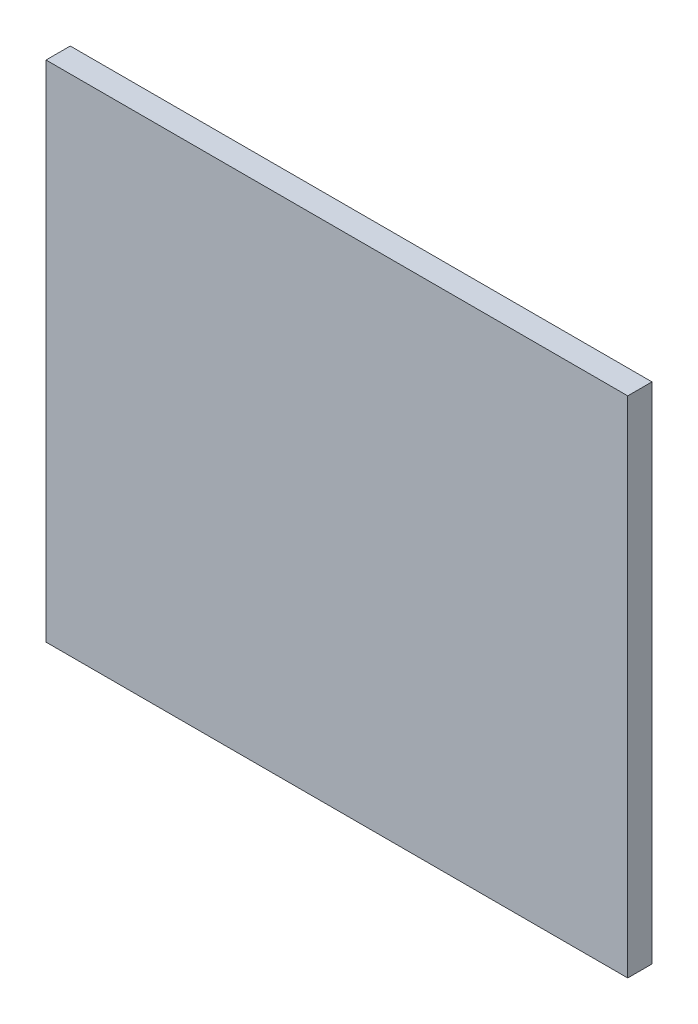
from build123d import *

# Parameters (mm, degrees)
SKETCH1_W           = 76.2
SKETCH1_H           = 66.04
BOSS_EXTRUDE1_DEPTH = 3.175


with BuildPart() as part:
    # Sketch1 → Boss-Extrude1 (new body)
    with BuildSketch(Plane.XY):
        Rectangle(SKETCH1_W, SKETCH1_H)
    extrude(amount=BOSS_EXTRUDE1_DEPTH)


solid = part.part
